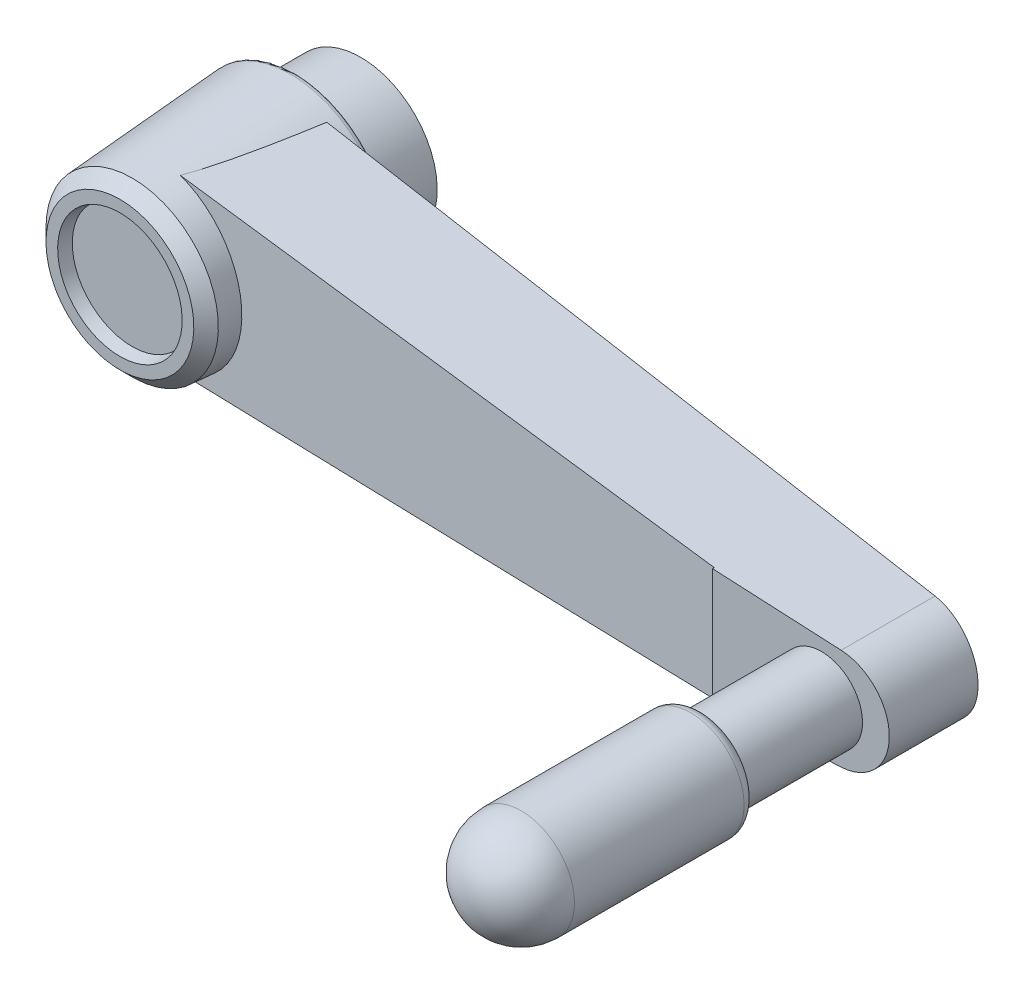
ISO-10303-21;
HEADER;
FILE_DESCRIPTION(('STEP AP214'),'2;1');
FILE_NAME('part.step','',(''),(''),'','','');
FILE_SCHEMA(('AUTOMOTIVE_DESIGN { 1 0 10303 214 1 1 1 1 }'));
ENDSEC;
DATA;
#1=APPLICATION_CONTEXT('core data for automotive mechanical design processes');
#2=APPLICATION_PROTOCOL_DEFINITION('international standard','automotive_design',2000,#1);
#3=PRODUCT_CONTEXT('',#1,'mechanical');
#4=PRODUCT('Part','Part','',(#3));
#5=PRODUCT_RELATED_PRODUCT_CATEGORY('part','',(#4));
#6=PRODUCT_DEFINITION_FORMATION('','',#4);
#7=PRODUCT_DEFINITION_CONTEXT('part definition',#1,'design');
#8=PRODUCT_DEFINITION('design','',#6,#7);
#9=PRODUCT_DEFINITION_SHAPE('','',#8);
#10=(LENGTH_UNIT() NAMED_UNIT(*) SI_UNIT(.MILLI.,.METRE.));
#11=(NAMED_UNIT(*) PLANE_ANGLE_UNIT() SI_UNIT($,.RADIAN.));
#12=(NAMED_UNIT(*) SI_UNIT($,.STERADIAN.) SOLID_ANGLE_UNIT());
#13=UNCERTAINTY_MEASURE_WITH_UNIT(LENGTH_MEASURE(1.E-05),#10,'distance_accuracy_value','');
#14=(GEOMETRIC_REPRESENTATION_CONTEXT(3) GLOBAL_UNCERTAINTY_ASSIGNED_CONTEXT((#13)) GLOBAL_UNIT_ASSIGNED_CONTEXT((#10,
#11,#12)) REPRESENTATION_CONTEXT('',''));
#15=CARTESIAN_POINT('',(0.,0.,0.));
#16=DIRECTION('',(0.,0.,1.));
#17=DIRECTION('',(1.,0.,0.));
#18=AXIS2_PLACEMENT_3D('',#15,#16,#17);
#19=CARTESIAN_POINT('',(0.,0.,30.0000000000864));
#20=DIRECTION('',(0.,0.,-1.));
#21=DIRECTION('',(0.,1.,0.));
#22=AXIS2_PLACEMENT_3D('',#19,#20,#21);
#23=CONICAL_SURFACE('',#22,7.99999999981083,1.04719755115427);
#24=CARTESIAN_POINT('',(1.98951966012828E-10,0.,34.6188021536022));
#25=VERTEX_POINT('',#24);
#26=VERTEX_LOOP('',#25);
#27=FACE_BOUND('',#26,.T.);
#28=CARTESIAN_POINT('',(0.,0.,30.));
#29=DIRECTION('',(0.,0.,-1.));
#30=DIRECTION('',(0.,1.,0.));
#31=AXIS2_PLACEMENT_3D('',#28,#29,#30);
#32=CIRCLE('',#31,8.);
#33=CARTESIAN_POINT('',(0.,8.,30.));
#34=VERTEX_POINT('',#33);
#35=EDGE_CURVE('E296',#34,#34,#32,.T.);
#36=ORIENTED_EDGE('',*,*,#35,.T.);
#37=EDGE_LOOP('',(#36));
#38=FACE_BOUND('',#37,.T.);
#39=ADVANCED_FACE('F15',(#27,#38),#23,.F.);
#40=CARTESIAN_POINT('',(0.,0.,15.55));
#41=DIRECTION('',(0.,0.,-1.));
#42=DIRECTION('',(0.,1.,0.));
#43=AXIS2_PLACEMENT_3D('',#40,#41,#42);
#44=CYLINDRICAL_SURFACE('',#43,8.);
#45=CARTESIAN_POINT('',(0.,0.,1.1));
#46=DIRECTION('',(0.,0.,-1.));
#47=DIRECTION('',(1.,0.,0.));
#48=AXIS2_PLACEMENT_3D('',#45,#46,#47);
#49=CIRCLE('',#48,8.);
#50=CARTESIAN_POINT('',(8.,0.,1.1));
#51=VERTEX_POINT('',#50);
#52=EDGE_CURVE('E287',#51,#51,#49,.T.);
#53=ORIENTED_EDGE('',*,*,#52,.T.);
#54=EDGE_LOOP('',(#53));
#55=FACE_BOUND('',#54,.T.);
#56=ORIENTED_EDGE('',*,*,#35,.F.);
#57=EDGE_LOOP('',(#56));
#58=FACE_BOUND('',#57,.T.);
#59=ADVANCED_FACE('F397',(#55,#58),#44,.F.);
#60=CARTESIAN_POINT('',(0.,0.,0.));
#61=DIRECTION('',(0.,0.,-1.));
#62=DIRECTION('',(0.,1.,0.));
#63=AXIS2_PLACEMENT_3D('',#60,#61,#62);
#64=CONICAL_SURFACE('',#63,9.1,0.785398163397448);
#65=CARTESIAN_POINT('',(0.,0.,0.));
#66=DIRECTION('',(0.,0.,-1.));
#67=DIRECTION('',(0.,1.,0.));
#68=AXIS2_PLACEMENT_3D('',#65,#66,#67);
#69=CIRCLE('',#68,9.1);
#70=CARTESIAN_POINT('',(0.,9.1,0.));
#71=VERTEX_POINT('',#70);
#72=EDGE_CURVE('E284',#71,#71,#69,.F.);
#73=ORIENTED_EDGE('',*,*,#72,.F.);
#74=EDGE_LOOP('',(#73));
#75=FACE_BOUND('',#74,.T.);
#76=ORIENTED_EDGE('',*,*,#52,.F.);
#77=EDGE_LOOP('',(#76));
#78=FACE_BOUND('',#77,.T.);
#79=ADVANCED_FACE('F402',(#75,#78),#64,.F.);
#80=CARTESIAN_POINT('',(-6.5,0.,0.));
#81=DIRECTION('',(0.,0.,-1.));
#82=DIRECTION('',(0.,1.,0.));
#83=AXIS2_PLACEMENT_3D('',#80,#81,#82);
#84=PLANE('',#83);
#85=CARTESIAN_POINT('',(0.,0.,0.));
#86=DIRECTION('',(0.,0.,1.));
#87=DIRECTION('',(0.,-1.,0.));
#88=AXIS2_PLACEMENT_3D('',#85,#86,#87);
#89=CIRCLE('',#88,13.);
#90=CARTESIAN_POINT('',(0.,-13.,0.));
#91=VERTEX_POINT('',#90);
#92=EDGE_CURVE('E281',#91,#91,#89,.T.);
#93=ORIENTED_EDGE('',*,*,#92,.F.);
#94=EDGE_LOOP('',(#93));
#95=FACE_BOUND('',#94,.T.);
#96=ORIENTED_EDGE('',*,*,#72,.T.);
#97=EDGE_LOOP('',(#96));
#98=FACE_BOUND('',#97,.T.);
#99=ADVANCED_FACE('F518',(#95,#98),#84,.T.);
#100=CARTESIAN_POINT('',(0.,0.,0.1));
#101=DIRECTION('',(0.,0.,1.));
#102=DIRECTION('',(0.,-1.,0.));
#103=AXIS2_PLACEMENT_3D('',#100,#101,#102);
#104=CYLINDRICAL_SURFACE('',#103,13.);
#105=ORIENTED_EDGE('',*,*,#92,.T.);
#106=EDGE_LOOP('',(#105));
#107=FACE_BOUND('',#106,.T.);
#108=CARTESIAN_POINT('',(0.,0.,0.200000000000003));
#109=DIRECTION('',(0.,0.,1.));
#110=DIRECTION('',(0.,-1.,0.));
#111=AXIS2_PLACEMENT_3D('',#108,#109,#110);
#112=CIRCLE('',#111,13.);
#113=CARTESIAN_POINT('',(0.,-13.,0.200000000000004));
#114=VERTEX_POINT('',#113);
#115=EDGE_CURVE('E278',#114,#114,#112,.T.);
#116=ORIENTED_EDGE('',*,*,#115,.F.);
#117=EDGE_LOOP('',(#116));
#118=FACE_BOUND('',#117,.T.);
#119=ADVANCED_FACE('F514',(#107,#118),#104,.T.);
#120=CARTESIAN_POINT('',(-15.125,0.,0.2));
#121=DIRECTION('',(0.,0.,-1.));
#122=DIRECTION('',(1.,0.,0.));
#123=AXIS2_PLACEMENT_3D('',#120,#121,#122);
#124=PLANE('',#123);
#125=CARTESIAN_POINT('',(0.,0.,0.2));
#126=DIRECTION('',(0.,0.,1.));
#127=DIRECTION('',(0.,-1.,0.));
#128=AXIS2_PLACEMENT_3D('',#125,#126,#127);
#129=CIRCLE('',#128,17.25);
#130=CARTESIAN_POINT('',(0.,-17.25,0.200000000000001));
#131=VERTEX_POINT('',#130);
#132=EDGE_CURVE('E271',#131,#131,#129,.T.);
#133=ORIENTED_EDGE('',*,*,#132,.F.);
#134=EDGE_LOOP('',(#133));
#135=FACE_BOUND('',#134,.T.);
#136=ORIENTED_EDGE('',*,*,#115,.T.);
#137=EDGE_LOOP('',(#136));
#138=FACE_BOUND('',#137,.T.);
#139=ADVANCED_FACE('F509',(#135,#138),#124,.T.);
#140=CARTESIAN_POINT('',(-6.75,0.,51.735));
#141=DIRECTION('',(0.,0.,1.));
#142=DIRECTION('',(0.,-1.,0.));
#143=AXIS2_PLACEMENT_3D('',#140,#141,#142);
#144=PLANE('',#143);
#145=CARTESIAN_POINT('',(0.,0.,51.735));
#146=DIRECTION('',(0.,0.,1.));
#147=DIRECTION('',(0.,-1.,0.));
#148=AXIS2_PLACEMENT_3D('',#145,#146,#147);
#149=CIRCLE('',#148,13.5);
#150=CARTESIAN_POINT('',(0.,-13.5,51.735));
#151=VERTEX_POINT('',#150);
#152=EDGE_CURVE('E263',#151,#151,#149,.T.);
#153=ORIENTED_EDGE('',*,*,#152,.T.);
#154=EDGE_LOOP('',(#153));
#155=FACE_BOUND('',#154,.T.);
#156=ADVANCED_FACE('F242',(#155),#144,.T.);
#157=CARTESIAN_POINT('',(0.,0.,7.6));
#158=DIRECTION('',(0.,0.,1.));
#159=DIRECTION('',(0.,-1.,0.));
#160=AXIS2_PLACEMENT_3D('',#157,#158,#159);
#161=CYLINDRICAL_SURFACE('',#160,17.25);
#162=ORIENTED_EDGE('',*,*,#132,.T.);
#163=EDGE_LOOP('',(#162));
#164=FACE_BOUND('',#163,.T.);
#165=CARTESIAN_POINT('',(0.,0.,15.));
#166=DIRECTION('',(0.,0.,1.));
#167=DIRECTION('',(0.,-1.,0.));
#168=AXIS2_PLACEMENT_3D('',#165,#166,#167);
#169=CIRCLE('',#168,17.25);
#170=CARTESIAN_POINT('',(0.,-17.25,15.));
#171=VERTEX_POINT('',#170);
#172=EDGE_CURVE('E266',#171,#171,#169,.T.);
#173=ORIENTED_EDGE('',*,*,#172,.F.);
#174=EDGE_LOOP('',(#173));
#175=FACE_BOUND('',#174,.T.);
#176=ADVANCED_FACE('F501',(#164,#175),#161,.T.);
#177=CARTESIAN_POINT('',(0.,0.,54.5));
#178=DIRECTION('',(0.,0.,1.));
#179=DIRECTION('',(0.,-1.,0.));
#180=AXIS2_PLACEMENT_3D('',#177,#178,#179);
#181=CONICAL_SURFACE('',#180,14.0374615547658,0.191986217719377);
#182=CARTESIAN_POINT('',(0.,0.,54.5));
#183=DIRECTION('',(0.,0.,1.));
#184=DIRECTION('',(0.,-1.,0.));
#185=AXIS2_PLACEMENT_3D('',#182,#183,#184);
#186=CIRCLE('',#185,14.0374615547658);
#187=CARTESIAN_POINT('',(0.,-14.0374615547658,54.5));
#188=VERTEX_POINT('',#187);
#189=EDGE_CURVE('E217',#188,#188,#186,.F.);
#190=ORIENTED_EDGE('',*,*,#189,.F.);
#191=EDGE_LOOP('',(#190));
#192=FACE_BOUND('',#191,.T.);
#193=ORIENTED_EDGE('',*,*,#152,.F.);
#194=EDGE_LOOP('',(#193));
#195=FACE_BOUND('',#194,.T.);
#196=ADVANCED_FACE('F240',(#192,#195),#181,.F.);
#197=CARTESIAN_POINT('',(-19.0888156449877,0.,15.));
#198=DIRECTION('',(0.,0.,-1.));
#199=DIRECTION('',(0.,1.,0.));
#200=AXIS2_PLACEMENT_3D('',#197,#198,#199);
#201=PLANE('',#200);
#202=CARTESIAN_POINT('',(0.,0.,15.));
#203=DIRECTION('',(0.,0.,1.));
#204=DIRECTION('',(0.,-1.,0.));
#205=AXIS2_PLACEMENT_3D('',#202,#203,#204);
#206=CIRCLE('',#205,20.9276312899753);
#207=CARTESIAN_POINT('',(0.,-20.9276312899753,15.));
#208=VERTEX_POINT('',#207);
#209=CARTESIAN_POINT('',(0.,20.9276312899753,15.));
#210=VERTEX_POINT('',#209);
#211=EDGE_CURVE('E147',#208,#210,#206,.T.);
#212=ORIENTED_EDGE('',*,*,#211,.F.);
#213=CARTESIAN_POINT('',(0.,0.,15.));
#214=DIRECTION('',(0.,0.,1.));
#215=DIRECTION('',(-1.,0.,0.));
#216=AXIS2_PLACEMENT_3D('',#213,#214,#215);
#217=CIRCLE('',#216,20.9276312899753);
#218=CARTESIAN_POINT('',(-20.9276312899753,0.,15.));
#219=VERTEX_POINT('',#218);
#220=EDGE_CURVE('E259',#219,#208,#217,.T.);
#221=ORIENTED_EDGE('',*,*,#220,.F.);
#222=CARTESIAN_POINT('',(0.,0.,15.));
#223=DIRECTION('',(0.,0.,1.));
#224=DIRECTION('',(0.,1.,0.));
#225=AXIS2_PLACEMENT_3D('',#222,#223,#224);
#226=CIRCLE('',#225,20.9276312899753);
#227=EDGE_CURVE('E223',#210,#219,#226,.T.);
#228=ORIENTED_EDGE('',*,*,#227,.F.);
#229=EDGE_LOOP('',(#212,#221,#228));
#230=FACE_BOUND('',#229,.T.);
#231=ORIENTED_EDGE('',*,*,#172,.T.);
#232=EDGE_LOOP('',(#231));
#233=FACE_BOUND('',#232,.T.);
#234=ADVANCED_FACE('F229',(#230,#233),#201,.T.);
#235=CARTESIAN_POINT('',(-15.3518500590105,0.,54.5));
#236=DIRECTION('',(0.,0.,1.));
#237=DIRECTION('',(0.,-1.,0.));
#238=AXIS2_PLACEMENT_3D('',#235,#236,#237);
#239=PLANE('',#238);
#240=ORIENTED_EDGE('',*,*,#189,.T.);
#241=EDGE_LOOP('',(#240));
#242=FACE_BOUND('',#241,.T.);
#243=CARTESIAN_POINT('',(0.,0.,54.5));
#244=DIRECTION('',(0.,0.,-1.));
#245=DIRECTION('',(0.,1.,0.));
#246=AXIS2_PLACEMENT_3D('',#243,#244,#245);
#247=CIRCLE('',#246,16.6662385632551);
#248=CARTESIAN_POINT('',(0.,16.6662385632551,54.5));
#249=VERTEX_POINT('',#248);
#250=EDGE_CURVE('E197',#249,#249,#247,.T.);
#251=ORIENTED_EDGE('',*,*,#250,.F.);
#252=EDGE_LOOP('',(#251));
#253=FACE_BOUND('',#252,.T.);
#254=ADVANCED_FACE('F239',(#242,#253),#239,.T.);
#255=CARTESIAN_POINT('',(0.,0.,51.735));
#256=DIRECTION('',(0.,0.,-1.));
#257=DIRECTION('',(0.,1.,0.));
#258=AXIS2_PLACEMENT_3D('',#255,#256,#257);
#259=CONICAL_SURFACE('',#258,19.4312385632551,0.785398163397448);
#260=CARTESIAN_POINT('',(0.,0.,51.735));
#261=DIRECTION('',(0.,0.,-1.));
#262=DIRECTION('',(-1.,0.,0.));
#263=AXIS2_PLACEMENT_3D('',#260,#261,#262);
#264=CIRCLE('',#263,19.4312385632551);
#265=CARTESIAN_POINT('',(-19.4312385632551,0.,51.735));
#266=VERTEX_POINT('',#265);
#267=EDGE_CURVE('E177',#266,#266,#264,.T.);
#268=ORIENTED_EDGE('',*,*,#267,.F.);
#269=EDGE_LOOP('',(#268));
#270=FACE_BOUND('',#269,.T.);
#271=ORIENTED_EDGE('',*,*,#250,.T.);
#272=EDGE_LOOP('',(#271));
#273=FACE_BOUND('',#272,.T.);
#274=ADVANCED_FACE('F166',(#270,#273),#259,.T.);
#275=CARTESIAN_POINT('',(0.,0.,16.));
#276=DIRECTION('',(0.,0.,-1.));
#277=DIRECTION('',(0.,1.,0.));
#278=AXIS2_PLACEMENT_3D('',#275,#276,#277);
#279=TOROIDAL_SURFACE('',#278,20.9276312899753,1.);
#280=ORIENTED_EDGE('',*,*,#220,.T.);
#281=ORIENTED_EDGE('',*,*,#211,.T.);
#282=ORIENTED_EDGE('',*,*,#227,.T.);
#283=EDGE_LOOP('',(#280,#281,#282));
#284=FACE_BOUND('',#283,.T.);
#285=CARTESIAN_POINT('',(0.,0.,16.0697564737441));
#286=DIRECTION('',(0.,0.,-1.));
#287=DIRECTION('',(-1.,0.,0.));
#288=AXIS2_PLACEMENT_3D('',#285,#286,#287);
#289=CIRCLE('',#288,21.9251953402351);
#290=CARTESIAN_POINT('',(-21.9251953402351,0.,16.0697564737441));
#291=VERTEX_POINT('',#290);
#292=EDGE_CURVE('E175',#291,#291,#289,.F.);
#293=ORIENTED_EDGE('',*,*,#292,.F.);
#294=EDGE_LOOP('',(#293));
#295=FACE_BOUND('',#294,.T.);
#296=ADVANCED_FACE('F154',(#284,#295),#279,.T.);
#297=CARTESIAN_POINT('',(-21.9,-39.5,43.6));
#298=DIRECTION('',(0.0762108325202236,0.,-0.997091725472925));
#299=DIRECTION('',(0.997091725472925,0.,0.0762108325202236));
#300=AXIS2_PLACEMENT_3D('',#297,#298,#299);
#301=PLANE('',#300);
#302=CARTESIAN_POINT('',(-0.106272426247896,0.,45.2657626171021));
#303=DIRECTION('',(0.0762108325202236,0.,-0.997091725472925));
#304=DIRECTION('',(-0.997091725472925,0.,-0.0762108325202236));
#305=AXIS2_PLACEMENT_3D('',#302,#303,#304);
#306=ELLIPSE('',#305,19.941607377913,19.8833277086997);
#307=CARTESIAN_POINT('',(4.74949230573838,-19.2813107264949,45.6369038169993));
#308=VERTEX_POINT('',#307);
#309=CARTESIAN_POINT('',(4.74949230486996,19.2813107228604,45.6369038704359));
#310=VERTEX_POINT('',#309);
#311=EDGE_CURVE('E181',#308,#310,#306,.F.);
#312=ORIENTED_EDGE('',*,*,#311,.F.);
#313=DIRECTION('',(-0.995886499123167,-0.0491530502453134,-0.0761187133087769));
#314=VECTOR('',#313,1.);
#315=CARTESIAN_POINT('',(135.1,-12.8477210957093,55.6));
#316=LINE('',#315,#314);
#317=CARTESIAN_POINT('',(135.1,-12.8477210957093,55.6));
#318=VERTEX_POINT('',#317);
#319=EDGE_CURVE('E203',#318,#308,#316,.T.);
#320=ORIENTED_EDGE('',*,*,#319,.F.);
#321=DIRECTION('',(0.,-1.,0.));
#322=VECTOR('',#321,1.);
#323=CARTESIAN_POINT('',(135.1,-39.5,55.6));
#324=LINE('',#323,#322);
#325=CARTESIAN_POINT('',(135.1,12.8477210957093,55.6));
#326=VERTEX_POINT('',#325);
#327=EDGE_CURVE('E191',#326,#318,#324,.T.);
#328=ORIENTED_EDGE('',*,*,#327,.F.);
#329=DIRECTION('',(0.995886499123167,-0.0491530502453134,0.076118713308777));
#330=VECTOR('',#329,1.);
#331=CARTESIAN_POINT('',(4.74949228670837,19.2813107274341,45.6369038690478));
#332=LINE('',#331,#330);
#333=EDGE_CURVE('E185',#310,#326,#332,.T.);
#334=ORIENTED_EDGE('',*,*,#333,.F.);
#335=EDGE_LOOP('',(#312,#320,#328,#334));
#336=FACE_BOUND('',#335,.T.);
#337=ADVANCED_FACE('F165',(#336),#301,.F.);
#338=CARTESIAN_POINT('',(0.,0.,16.0697564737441));
#339=DIRECTION('',(0.,0.,-1.));
#340=DIRECTION('',(0.,1.,0.));
#341=AXIS2_PLACEMENT_3D('',#338,#339,#340);
#342=CONICAL_SURFACE('',#341,21.9251953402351,0.0698131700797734);
#343=ORIENTED_EDGE('',*,*,#292,.T.);
#344=EDGE_LOOP('',(#343));
#345=FACE_BOUND('',#344,.T.);
#346=CARTESIAN_POINT('',(-0.162782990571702,0.,17.3171652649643));
#347=DIRECTION('',(-0.105998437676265,0.,0.994366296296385));
#348=DIRECTION('',(-0.994366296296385,0.,-0.105998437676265));
#349=AXIS2_PLACEMENT_3D('',#346,#347,#348);
#350=ELLIPSE('',#349,21.9616936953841,21.8373613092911);
#351=CARTESIAN_POINT('',(10.6163852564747,18.9917439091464,18.4662137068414));
#352=VERTEX_POINT('',#351);
#353=CARTESIAN_POINT('',(10.6163852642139,-18.9917439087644,18.4662136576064));
#354=VERTEX_POINT('',#353);
#355=EDGE_CURVE('E291',#352,#354,#350,.F.);
#356=ORIENTED_EDGE('',*,*,#355,.T.);
#357=CARTESIAN_POINT('',(10.6163852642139,-18.9917439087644,18.4662136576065));
#358=CARTESIAN_POINT('',(10.4361579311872,-19.0006392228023,19.6121865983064));
#359=CARTESIAN_POINT('',(10.2521510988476,-19.0097210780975,20.7575811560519));
#360=CARTESIAN_POINT('',(9.87473300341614,-19.0283489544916,23.0467138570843));
#361=CARTESIAN_POINT('',(9.68132253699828,-19.0378949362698,24.190452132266));
#362=CARTESIAN_POINT('',(9.28353265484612,-19.057528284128,26.4741824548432));
#363=CARTESIAN_POINT('',(9.07917083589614,-19.0676147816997,27.6141775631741));
#364=CARTESIAN_POINT('',(8.6564662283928,-19.0884778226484,29.8917311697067));
#365=CARTESIAN_POINT('',(8.43812174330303,-19.0992544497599,31.0292893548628));
#366=CARTESIAN_POINT('',(8.09707608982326,-19.1160871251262,32.7333362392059));
#367=CARTESIAN_POINT('',(7.98109510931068,-19.121811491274,33.3011745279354));
#368=CARTESIAN_POINT('',(7.74394249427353,-19.1335164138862,34.4357597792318));
#369=CARTESIAN_POINT('',(7.62277092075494,-19.1394969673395,35.0025067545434));
#370=CARTESIAN_POINT('',(7.37441935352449,-19.151754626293,36.1345051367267));
#371=CARTESIAN_POINT('',(7.24724116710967,-19.158031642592,36.6997569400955));
#372=CARTESIAN_POINT('',(6.98572118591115,-19.1709392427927,37.8286300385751));
#373=CARTESIAN_POINT('',(6.85137907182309,-19.1775698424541,38.3922512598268));
#374=CARTESIAN_POINT('',(6.57381367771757,-19.1912693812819,39.5183010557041));
#375=CARTESIAN_POINT('',(6.43057596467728,-19.1983390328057,40.0807260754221));
#376=CARTESIAN_POINT('',(6.13337897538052,-19.2130075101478,41.2026819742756));
#377=CARTESIAN_POINT('',(5.97942102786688,-19.2206062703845,41.7622132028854));
#378=CARTESIAN_POINT('',(5.73806291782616,-19.2325187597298,42.5988017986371));
#379=CARTESIAN_POINT('',(5.6558287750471,-19.2365775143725,42.877354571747));
#380=CARTESIAN_POINT('',(5.48736442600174,-19.244892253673,43.4332386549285));
#381=CARTESIAN_POINT('',(5.40113435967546,-19.249148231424,43.7105700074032));
#382=CARTESIAN_POINT('',(5.22399878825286,-19.2578909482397,44.263864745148));
#383=CARTESIAN_POINT('',(5.13309138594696,-19.2623777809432,44.5398275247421));
#384=CARTESIAN_POINT('',(4.94570156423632,-19.2716266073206,45.0898825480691));
#385=CARTESIAN_POINT('',(4.84921847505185,-19.2763886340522,45.3639745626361));
#386=CARTESIAN_POINT('',(4.74949232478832,-19.2813107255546,45.6369037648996));
#387=B_SPLINE_CURVE_WITH_KNOTS('',3,(#357,#358,#359,#360,#361,#362,#363,#364,#365,#366,#367,
#368,#369,#370,#371,#372,#373,#374,#375,#376,#377,#378,#379,#380,#381,#382,#383,#384,#385,#386),
.UNSPECIFIED.,.F.,.F.,(4,2,2,2,2,2,2,2,2,2,2,2,2,2,4),(0.,3.48029795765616,6.96030157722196,
10.4348720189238,13.9098648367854,15.6486159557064,17.3873466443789,19.1255574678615,
20.8638458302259,22.6050322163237,24.3460031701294,25.2173773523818,26.0887210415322,
26.9604209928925,27.8322258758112),.UNSPECIFIED.);
#388=EDGE_CURVE('E421',#354,#308,#387,.T.);
#389=ORIENTED_EDGE('',*,*,#388,.T.);
#390=ORIENTED_EDGE('',*,*,#311,.T.);
#391=CARTESIAN_POINT('',(4.74949229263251,19.2813107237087,45.6369038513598));
#392=CARTESIAN_POINT('',(4.84921844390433,19.2763886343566,45.3639746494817));
#393=CARTESIAN_POINT('',(4.94570153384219,19.2716266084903,45.0898826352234));
#394=CARTESIAN_POINT('',(5.13309135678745,19.2623777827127,44.5398276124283));
#395=CARTESIAN_POINT('',(5.22399875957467,19.2578909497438,44.2638648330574));
#396=CARTESIAN_POINT('',(5.4011343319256,19.249148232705,43.7105700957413));
#397=CARTESIAN_POINT('',(5.48736439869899,19.2448922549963,43.4332387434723));
#398=CARTESIAN_POINT('',(5.65582874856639,19.2365775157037,42.8773546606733));
#399=CARTESIAN_POINT('',(5.73806289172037,19.2325187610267,42.5988018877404));
#400=CARTESIAN_POINT('',(5.97942100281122,19.2206062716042,41.7622132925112));
#401=CARTESIAN_POINT('',(6.13337895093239,19.2130075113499,41.2026820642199));
#402=CARTESIAN_POINT('',(6.43057594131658,19.1983390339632,40.0807261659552));
#403=CARTESIAN_POINT('',(6.5738136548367,19.1912693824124,39.5183011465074));
#404=CARTESIAN_POINT('',(6.85137904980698,19.1775698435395,38.3922513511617));
#405=CARTESIAN_POINT('',(6.98572116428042,19.17093924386,37.8286301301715));
#406=CARTESIAN_POINT('',(7.24724114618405,19.1580316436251,36.6997570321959));
#407=CARTESIAN_POINT('',(7.37441933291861,19.15175462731,36.1345052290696));
#408=CARTESIAN_POINT('',(7.62277090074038,19.1394969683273,35.0025068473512));
#409=CARTESIAN_POINT('',(7.74394247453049,19.1335164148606,34.4357598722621));
#410=CARTESIAN_POINT('',(7.98109509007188,19.1218114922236,33.3011746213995));
#411=CARTESIAN_POINT('',(8.0970760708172,19.1160871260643,32.7333363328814));
#412=CARTESIAN_POINT('',(8.43812172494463,19.099254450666,31.0292894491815));
#413=CARTESIAN_POINT('',(8.65646621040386,19.0884778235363,29.8917312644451));
#414=CARTESIAN_POINT('',(9.07917081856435,19.0676147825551,27.6141776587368));
#415=CARTESIAN_POINT('',(9.28353263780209,19.0575282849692,26.4741825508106));
#416=CARTESIAN_POINT('',(9.68132252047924,19.0378949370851,24.1904522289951));
#417=CARTESIAN_POINT('',(9.8747329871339,19.0283489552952,23.0467139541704));
#418=CARTESIAN_POINT('',(10.2521510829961,19.0097210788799,20.7575812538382));
#419=CARTESIAN_POINT('',(10.4361579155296,19.0006392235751,19.6121866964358));
#420=CARTESIAN_POINT('',(10.6163852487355,18.9917439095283,18.4662137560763));
#421=B_SPLINE_CURVE_WITH_KNOTS('',3,(#391,#392,#393,#394,#395,#396,#397,#398,#399,#400,#401,
#402,#403,#404,#405,#406,#407,#408,#409,#410,#411,#412,#413,#414,#415,#416,#417,#418,#419,#420),
.UNSPECIFIED.,.F.,.F.,(4,2,2,2,2,2,2,2,2,2,2,2,2,2,4),(0.,0.871804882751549,1.74350483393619,
2.61484852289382,3.48622270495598,5.22719365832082,6.96838004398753,8.70666840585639,
10.4448792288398,12.1836099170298,13.9223610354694,17.3973538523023,20.8719242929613,
24.3519279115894,27.8322258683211),.UNSPECIFIED.);
#422=EDGE_CURVE('E37',#310,#352,#421,.T.);
#423=ORIENTED_EDGE('',*,*,#422,.T.);
#424=EDGE_LOOP('',(#356,#389,#390,#423));
#425=FACE_BOUND('',#424,.T.);
#426=ORIENTED_EDGE('',*,*,#267,.T.);
#427=EDGE_LOOP('',(#426));
#428=FACE_BOUND('',#427,.T.);
#429=ADVANCED_FACE('F440',(#345,#425,#428),#342,.T.);
#430=CARTESIAN_POINT('',(0.960878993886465,-19.4683018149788,94.));
#431=DIRECTION('',(0.0492960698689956,-0.998784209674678,0.));
#432=DIRECTION('',(0.998784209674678,0.0492960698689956,0.));
#433=AXIS2_PLACEMENT_3D('',#430,#431,#432);
#434=PLANE('',#433);
#435=DIRECTION('',(-1.42108547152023E-13,0.,1.));
#436=VECTOR('',#435,1.);
#437=CARTESIAN_POINT('',(135.1,-12.8477210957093,55.6));
#438=LINE('',#437,#436);
#439=CARTESIAN_POINT('',(135.1,-12.8477210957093,56.));
#440=VERTEX_POINT('',#439);
#441=EDGE_CURVE('E212',#440,#318,#438,.F.);
#442=ORIENTED_EDGE('',*,*,#441,.T.);
#443=ORIENTED_EDGE('',*,*,#319,.T.);
#444=ORIENTED_EDGE('',*,*,#388,.F.);
#445=DIRECTION('',(0.993170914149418,0.0490190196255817,0.105871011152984));
#446=VECTOR('',#445,1.);
#447=CARTESIAN_POINT('',(10.6163852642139,-18.9917439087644,18.4662136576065));
#448=LINE('',#447,#446);
#449=CARTESIAN_POINT('',(164.134812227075,-11.4146766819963,34.8311221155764));
#450=VERTEX_POINT('',#449);
#451=EDGE_CURVE('E417',#354,#450,#448,.T.);
#452=ORIENTED_EDGE('',*,*,#451,.T.);
#453=DIRECTION('',(0.,0.,1.));
#454=VECTOR('',#453,1.);
#455=CARTESIAN_POINT('',(164.134812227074,-11.4146766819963,94.));
#456=LINE('',#455,#454);
#457=CARTESIAN_POINT('',(164.134812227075,-11.4146766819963,56.));
#458=VERTEX_POINT('',#457);
#459=EDGE_CURVE('E463',#458,#450,#456,.F.);
#460=ORIENTED_EDGE('',*,*,#459,.F.);
#461=DIRECTION('',(0.998784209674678,0.0492960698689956,0.));
#462=VECTOR('',#461,1.);
#463=CARTESIAN_POINT('',(0.960878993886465,-19.4683018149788,56.));
#464=LINE('',#463,#462);
#465=EDGE_CURVE('E200',#458,#440,#464,.F.);
#466=ORIENTED_EDGE('',*,*,#465,.T.);
#467=EDGE_LOOP('',(#442,#443,#444,#452,#460,#466));
#468=FACE_BOUND('',#467,.T.);
#469=ADVANCED_FACE('F436',(#468),#434,.T.);
#470=CARTESIAN_POINT('',(135.1,-39.5,55.6));
#471=DIRECTION('',(1.,0.,1.42108547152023E-13));
#472=DIRECTION('',(-1.42108547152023E-13,0.,1.));
#473=AXIS2_PLACEMENT_3D('',#470,#471,#472);
#474=PLANE('',#473);
#475=DIRECTION('',(0.,-1.,0.));
#476=VECTOR('',#475,1.);
#477=CARTESIAN_POINT('',(135.1,-39.5,56.));
#478=LINE('',#477,#476);
#479=CARTESIAN_POINT('',(135.1,12.8477210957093,56.));
#480=VERTEX_POINT('',#479);
#481=EDGE_CURVE('E188',#440,#480,#478,.F.);
#482=ORIENTED_EDGE('',*,*,#481,.T.);
#483=DIRECTION('',(-1.42108547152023E-13,0.,1.));
#484=VECTOR('',#483,1.);
#485=CARTESIAN_POINT('',(135.1,12.8477210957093,55.6));
#486=LINE('',#485,#484);
#487=EDGE_CURVE('E209',#326,#480,#486,.T.);
#488=ORIENTED_EDGE('',*,*,#487,.F.);
#489=ORIENTED_EDGE('',*,*,#327,.T.);
#490=ORIENTED_EDGE('',*,*,#441,.F.);
#491=EDGE_LOOP('',(#482,#488,#489,#490));
#492=FACE_BOUND('',#491,.T.);
#493=ADVANCED_FACE('F451',(#492),#474,.F.);
#494=CARTESIAN_POINT('',(164.134812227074,11.4146766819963,94.));
#495=DIRECTION('',(0.0492960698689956,0.998784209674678,0.));
#496=DIRECTION('',(-0.998784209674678,0.0492960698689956,0.));
#497=AXIS2_PLACEMENT_3D('',#494,#495,#496);
#498=PLANE('',#497);
#499=DIRECTION('',(0.,0.,1.));
#500=VECTOR('',#499,1.);
#501=CARTESIAN_POINT('',(164.134812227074,11.4146766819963,94.));
#502=LINE('',#501,#500);
#503=CARTESIAN_POINT('',(164.134812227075,11.4146766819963,56.));
#504=VERTEX_POINT('',#503);
#505=CARTESIAN_POINT('',(164.134812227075,11.4146766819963,34.8311221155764));
#506=VERTEX_POINT('',#505);
#507=EDGE_CURVE('E184',#504,#506,#502,.F.);
#508=ORIENTED_EDGE('',*,*,#507,.T.);
#509=DIRECTION('',(-0.993170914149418,0.0490190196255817,-0.105871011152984));
#510=VECTOR('',#509,1.);
#511=CARTESIAN_POINT('',(164.134812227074,11.4146766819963,34.8311221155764));
#512=LINE('',#511,#510);
#513=EDGE_CURVE('E413',#506,#352,#512,.T.);
#514=ORIENTED_EDGE('',*,*,#513,.T.);
#515=ORIENTED_EDGE('',*,*,#422,.F.);
#516=ORIENTED_EDGE('',*,*,#333,.T.);
#517=ORIENTED_EDGE('',*,*,#487,.T.);
#518=DIRECTION('',(-0.998784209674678,0.0492960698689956,0.));
#519=VECTOR('',#518,1.);
#520=CARTESIAN_POINT('',(164.134812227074,11.4146766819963,56.));
#521=LINE('',#520,#519);
#522=EDGE_CURVE('E182',#480,#504,#521,.F.);
#523=ORIENTED_EDGE('',*,*,#522,.T.);
#524=EDGE_LOOP('',(#508,#514,#515,#516,#517,#523));
#525=FACE_BOUND('',#524,.T.);
#526=ADVANCED_FACE('F446',(#525),#498,.T.);
#527=CARTESIAN_POINT('',(163.571428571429,0.,94.));
#528=DIRECTION('',(0.,0.,1.));
#529=DIRECTION('',(0.,-1.,0.));
#530=AXIS2_PLACEMENT_3D('',#527,#528,#529);
#531=CYLINDRICAL_SURFACE('',#530,11.4285714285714);
#532=CARTESIAN_POINT('',(163.571428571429,0.,34.7710659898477));
#533=DIRECTION('',(-0.105998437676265,0.,0.994366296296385));
#534=DIRECTION('',(0.994366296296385,0.,0.105998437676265));
#535=AXIS2_PLACEMENT_3D('',#532,#533,#534);
#536=ELLIPSE('',#535,11.4933213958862,11.4285714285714);
#537=EDGE_CURVE('E414',#450,#506,#536,.T.);
#538=ORIENTED_EDGE('',*,*,#537,.T.);
#539=ORIENTED_EDGE('',*,*,#507,.F.);
#540=CARTESIAN_POINT('',(163.571428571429,0.,56.));
#541=DIRECTION('',(0.,0.,1.));
#542=DIRECTION('',(0.,-1.,0.));
#543=AXIS2_PLACEMENT_3D('',#540,#541,#542);
#544=CIRCLE('',#543,11.4285714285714);
#545=EDGE_CURVE('E484',#504,#458,#544,.F.);
#546=ORIENTED_EDGE('',*,*,#545,.T.);
#547=ORIENTED_EDGE('',*,*,#459,.T.);
#548=EDGE_LOOP('',(#538,#539,#546,#547));
#549=FACE_BOUND('',#548,.T.);
#550=ADVANCED_FACE('F450',(#549),#531,.T.);
#551=CARTESIAN_POINT('',(135.1,-39.5,56.));
#552=DIRECTION('',(0.,0.,-1.));
#553=DIRECTION('',(1.,0.,0.));
#554=AXIS2_PLACEMENT_3D('',#551,#552,#553);
#555=PLANE('',#554);
#556=CARTESIAN_POINT('',(160.,0.,56.));
#557=DIRECTION('',(0.,0.,-1.));
#558=DIRECTION('',(-1.,0.,0.));
#559=AXIS2_PLACEMENT_3D('',#556,#557,#558);
#560=CIRCLE('',#559,6.9375);
#561=CARTESIAN_POINT('',(153.0625,0.,56.));
#562=VERTEX_POINT('',#561);
#563=EDGE_CURVE('E9',#562,#562,#560,.T.);
#564=ORIENTED_EDGE('',*,*,#563,.T.);
#565=EDGE_LOOP('',(#564));
#566=FACE_BOUND('',#565,.T.);
#567=ORIENTED_EDGE('',*,*,#545,.F.);
#568=ORIENTED_EDGE('',*,*,#522,.F.);
#569=ORIENTED_EDGE('',*,*,#481,.F.);
#570=ORIENTED_EDGE('',*,*,#465,.F.);
#571=EDGE_LOOP('',(#567,#568,#569,#570));
#572=FACE_BOUND('',#571,.T.);
#573=ADVANCED_FACE('F168',(#566,#572),#555,.F.);
#574=CARTESIAN_POINT('',(175.1,-39.5,36.));
#575=DIRECTION('',(-0.105998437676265,0.,0.994366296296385));
#576=DIRECTION('',(-0.994366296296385,0.,-0.105998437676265));
#577=AXIS2_PLACEMENT_3D('',#574,#575,#576);
#578=PLANE('',#577);
#579=ORIENTED_EDGE('',*,*,#355,.F.);
#580=ORIENTED_EDGE('',*,*,#513,.F.);
#581=ORIENTED_EDGE('',*,*,#537,.F.);
#582=ORIENTED_EDGE('',*,*,#451,.F.);
#583=EDGE_LOOP('',(#579,#580,#581,#582));
#584=FACE_BOUND('',#583,.T.);
#585=CARTESIAN_POINT('',(160.,0.,34.3903553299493));
#586=DIRECTION('',(-0.105998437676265,0.,0.994366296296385));
#587=DIRECTION('',(-0.994366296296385,0.,-0.105998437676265));
#588=AXIS2_PLACEMENT_3D('',#585,#586,#587);
#589=ELLIPSE('',#588,3.34232969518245,3.3235);
#590=CARTESIAN_POINT('',(156.6765,0.,34.0360736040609));
#591=VERTEX_POINT('',#590);
#592=EDGE_CURVE('E180',#591,#591,#589,.F.);
#593=ORIENTED_EDGE('',*,*,#592,.F.);
#594=EDGE_LOOP('',(#593));
#595=FACE_BOUND('',#594,.T.);
#596=ADVANCED_FACE('F445',(#584,#595),#578,.F.);
#597=CARTESIAN_POINT('',(160.,0.,44.66175));
#598=DIRECTION('',(0.,0.,-1.));
#599=DIRECTION('',(0.,1.,0.));
#600=AXIS2_PLACEMENT_3D('',#597,#598,#599);
#601=CYLINDRICAL_SURFACE('',#600,3.3235);
#602=ORIENTED_EDGE('',*,*,#592,.T.);
#603=EDGE_LOOP('',(#602));
#604=FACE_BOUND('',#603,.T.);
#605=CARTESIAN_POINT('',(160.,0.,41.0904999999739));
#606=DIRECTION('',(0.,0.,1.));
#607=DIRECTION('',(0.,-1.,0.));
#608=AXIS2_PLACEMENT_3D('',#605,#606,#607);
#609=CIRCLE('',#608,3.3235);
#610=CARTESIAN_POINT('',(160.,-3.3235,41.0904999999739));
#611=VERTEX_POINT('',#610);
#612=EDGE_CURVE('E28',#611,#611,#609,.T.);
#613=ORIENTED_EDGE('',*,*,#612,.T.);
#614=EDGE_LOOP('',(#613));
#615=FACE_BOUND('',#614,.T.);
#616=ADVANCED_FACE('F393',(#604,#615),#601,.F.);
#617=CARTESIAN_POINT('',(160.,0.,45.));
#618=DIRECTION('',(0.,0.,1.));
#619=DIRECTION('',(0.,-1.,0.));
#620=AXIS2_PLACEMENT_3D('',#617,#618,#619);
#621=PLANE('',#620);
#622=DIRECTION('',(-0.866025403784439,0.5,0.));
#623=VECTOR('',#622,1.);
#624=CARTESIAN_POINT('',(160.,2.30940107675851,45.));
#625=LINE('',#624,#623);
#626=CARTESIAN_POINT('',(160.,2.30940107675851,45.));
#627=VERTEX_POINT('',#626);
#628=CARTESIAN_POINT('',(162.,1.15470053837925,45.));
#629=VERTEX_POINT('',#628);
#630=EDGE_CURVE('E354',#627,#629,#625,.F.);
#631=ORIENTED_EDGE('',*,*,#630,.T.);
#632=DIRECTION('',(0.,1.,0.));
#633=VECTOR('',#632,1.);
#634=CARTESIAN_POINT('',(162.,1.15470053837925,45.));
#635=LINE('',#634,#633);
#636=CARTESIAN_POINT('',(162.,-1.15470053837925,45.));
#637=VERTEX_POINT('',#636);
#638=EDGE_CURVE('E359',#629,#637,#635,.F.);
#639=ORIENTED_EDGE('',*,*,#638,.T.);
#640=DIRECTION('',(0.866025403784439,0.5,0.));
#641=VECTOR('',#640,1.);
#642=CARTESIAN_POINT('',(162.,-1.15470053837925,45.));
#643=LINE('',#642,#641);
#644=CARTESIAN_POINT('',(160.,-2.3094010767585,45.));
#645=VERTEX_POINT('',#644);
#646=EDGE_CURVE('E364',#637,#645,#643,.F.);
#647=ORIENTED_EDGE('',*,*,#646,.T.);
#648=DIRECTION('',(0.866025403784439,-0.5,0.));
#649=VECTOR('',#648,1.);
#650=CARTESIAN_POINT('',(160.,-2.30940107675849,45.));
#651=LINE('',#650,#649);
#652=CARTESIAN_POINT('',(158.,-1.15470053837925,45.));
#653=VERTEX_POINT('',#652);
#654=EDGE_CURVE('E114',#645,#653,#651,.F.);
#655=ORIENTED_EDGE('',*,*,#654,.T.);
#656=DIRECTION('',(0.,-1.,0.));
#657=VECTOR('',#656,1.);
#658=CARTESIAN_POINT('',(158.,-1.15470053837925,45.));
#659=LINE('',#658,#657);
#660=CARTESIAN_POINT('',(158.,1.15470053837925,45.));
#661=VERTEX_POINT('',#660);
#662=EDGE_CURVE('E98',#653,#661,#659,.F.);
#663=ORIENTED_EDGE('',*,*,#662,.T.);
#664=DIRECTION('',(-0.866025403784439,-0.5,0.));
#665=VECTOR('',#664,1.);
#666=CARTESIAN_POINT('',(158.,1.15470053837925,45.));
#667=LINE('',#666,#665);
#668=EDGE_CURVE('E103',#661,#627,#667,.F.);
#669=ORIENTED_EDGE('',*,*,#668,.T.);
#670=EDGE_LOOP('',(#631,#639,#647,#655,#663,#669));
#671=FACE_BOUND('',#670,.T.);
#672=ADVANCED_FACE('F17',(#671),#621,.F.);
#673=CARTESIAN_POINT('',(162.,-1.15470053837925,41.));
#674=DIRECTION('',(0.5,-0.866025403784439,0.));
#675=DIRECTION('',(0.866025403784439,0.5,0.));
#676=AXIS2_PLACEMENT_3D('',#673,#674,#675);
#677=PLANE('',#676);
#678=DIRECTION('',(0.,0.,1.));
#679=VECTOR('',#678,1.);
#680=CARTESIAN_POINT('',(162.,-1.15470053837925,41.));
#681=LINE('',#680,#679);
#682=CARTESIAN_POINT('',(162.,-1.15470053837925,41.));
#683=VERTEX_POINT('',#682);
#684=EDGE_CURVE('E362',#637,#683,#681,.F.);
#685=ORIENTED_EDGE('',*,*,#684,.T.);
#686=DIRECTION('',(0.866025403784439,0.5,0.));
#687=VECTOR('',#686,1.);
#688=CARTESIAN_POINT('',(160.,-2.30940107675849,41.));
#689=LINE('',#688,#687);
#690=CARTESIAN_POINT('',(160.,-2.3094010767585,41.));
#691=VERTEX_POINT('',#690);
#692=EDGE_CURVE('E345',#691,#683,#689,.T.);
#693=ORIENTED_EDGE('',*,*,#692,.F.);
#694=DIRECTION('',(0.,0.,1.));
#695=VECTOR('',#694,1.);
#696=CARTESIAN_POINT('',(160.,-2.3094010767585,41.));
#697=LINE('',#696,#695);
#698=EDGE_CURVE('E366',#645,#691,#697,.F.);
#699=ORIENTED_EDGE('',*,*,#698,.F.);
#700=ORIENTED_EDGE('',*,*,#646,.F.);
#701=EDGE_LOOP('',(#685,#693,#699,#700));
#702=FACE_BOUND('',#701,.T.);
#703=ADVANCED_FACE('F384',(#702),#677,.F.);
#704=CARTESIAN_POINT('',(160.,-2.30940107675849,41.));
#705=DIRECTION('',(-0.5,-0.866025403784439,0.));
#706=DIRECTION('',(0.866025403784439,-0.5,0.));
#707=AXIS2_PLACEMENT_3D('',#704,#705,#706);
#708=PLANE('',#707);
#709=ORIENTED_EDGE('',*,*,#698,.T.);
#710=DIRECTION('',(0.866025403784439,-0.5,0.));
#711=VECTOR('',#710,1.);
#712=CARTESIAN_POINT('',(158.,-1.15470053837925,41.));
#713=LINE('',#712,#711);
#714=CARTESIAN_POINT('',(158.,-1.15470053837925,41.));
#715=VERTEX_POINT('',#714);
#716=EDGE_CURVE('E348',#715,#691,#713,.T.);
#717=ORIENTED_EDGE('',*,*,#716,.F.);
#718=DIRECTION('',(0.,0.,1.));
#719=VECTOR('',#718,1.);
#720=CARTESIAN_POINT('',(158.,-1.15470053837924,41.));
#721=LINE('',#720,#719);
#722=EDGE_CURVE('E116',#653,#715,#721,.F.);
#723=ORIENTED_EDGE('',*,*,#722,.F.);
#724=ORIENTED_EDGE('',*,*,#654,.F.);
#725=EDGE_LOOP('',(#709,#717,#723,#724));
#726=FACE_BOUND('',#725,.T.);
#727=ADVANCED_FACE('F370',(#726),#708,.F.);
#728=CARTESIAN_POINT('',(158.,-1.15470053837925,41.));
#729=DIRECTION('',(-1.,0.,0.));
#730=DIRECTION('',(0.,-1.,0.));
#731=AXIS2_PLACEMENT_3D('',#728,#729,#730);
#732=PLANE('',#731);
#733=ORIENTED_EDGE('',*,*,#722,.T.);
#734=DIRECTION('',(0.,1.,0.));
#735=VECTOR('',#734,1.);
#736=CARTESIAN_POINT('',(158.,1.6165,41.));
#737=LINE('',#736,#735);
#738=CARTESIAN_POINT('',(158.,1.15470053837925,41.));
#739=VERTEX_POINT('',#738);
#740=EDGE_CURVE('E120',#739,#715,#737,.F.);
#741=ORIENTED_EDGE('',*,*,#740,.F.);
#742=DIRECTION('',(0.,0.,1.));
#743=VECTOR('',#742,1.);
#744=CARTESIAN_POINT('',(158.,1.15470053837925,41.));
#745=LINE('',#744,#743);
#746=EDGE_CURVE('E105',#661,#739,#745,.F.);
#747=ORIENTED_EDGE('',*,*,#746,.F.);
#748=ORIENTED_EDGE('',*,*,#662,.F.);
#749=EDGE_LOOP('',(#733,#741,#747,#748));
#750=FACE_BOUND('',#749,.T.);
#751=ADVANCED_FACE('F118',(#750),#732,.F.);
#752=CARTESIAN_POINT('',(158.,1.15470053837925,41.));
#753=DIRECTION('',(-0.5,0.866025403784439,0.));
#754=DIRECTION('',(-0.866025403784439,-0.5,0.));
#755=AXIS2_PLACEMENT_3D('',#752,#753,#754);
#756=PLANE('',#755);
#757=ORIENTED_EDGE('',*,*,#746,.T.);
#758=DIRECTION('',(-0.866025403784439,-0.5,0.));
#759=VECTOR('',#758,1.);
#760=CARTESIAN_POINT('',(160.,2.30940107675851,41.));
#761=LINE('',#760,#759);
#762=CARTESIAN_POINT('',(160.,2.30940107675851,41.));
#763=VERTEX_POINT('',#762);
#764=EDGE_CURVE('E352',#763,#739,#761,.T.);
#765=ORIENTED_EDGE('',*,*,#764,.F.);
#766=DIRECTION('',(0.,0.,1.));
#767=VECTOR('',#766,1.);
#768=CARTESIAN_POINT('',(160.,2.30940107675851,41.));
#769=LINE('',#768,#767);
#770=EDGE_CURVE('E108',#763,#627,#769,.T.);
#771=ORIENTED_EDGE('',*,*,#770,.T.);
#772=ORIENTED_EDGE('',*,*,#668,.F.);
#773=EDGE_LOOP('',(#757,#765,#771,#772));
#774=FACE_BOUND('',#773,.T.);
#775=ADVANCED_FACE('F104',(#774),#756,.F.);
#776=CARTESIAN_POINT('',(160.,2.30940107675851,41.));
#777=DIRECTION('',(0.5,0.866025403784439,0.));
#778=DIRECTION('',(-0.866025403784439,0.5,0.));
#779=AXIS2_PLACEMENT_3D('',#776,#777,#778);
#780=PLANE('',#779);
#781=ORIENTED_EDGE('',*,*,#770,.F.);
#782=DIRECTION('',(-0.866025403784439,0.5,0.));
#783=VECTOR('',#782,1.);
#784=CARTESIAN_POINT('',(162.,1.15470053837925,41.));
#785=LINE('',#784,#783);
#786=CARTESIAN_POINT('',(162.,1.15470053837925,41.));
#787=VERTEX_POINT('',#786);
#788=EDGE_CURVE('E139',#787,#763,#785,.T.);
#789=ORIENTED_EDGE('',*,*,#788,.F.);
#790=DIRECTION('',(0.,0.,1.));
#791=VECTOR('',#790,1.);
#792=CARTESIAN_POINT('',(162.,1.15470053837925,41.));
#793=LINE('',#792,#791);
#794=EDGE_CURVE('E357',#629,#787,#793,.F.);
#795=ORIENTED_EDGE('',*,*,#794,.F.);
#796=ORIENTED_EDGE('',*,*,#630,.F.);
#797=EDGE_LOOP('',(#781,#789,#795,#796));
#798=FACE_BOUND('',#797,.T.);
#799=ADVANCED_FACE('F377',(#798),#780,.F.);
#800=CARTESIAN_POINT('',(162.,1.15470053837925,41.));
#801=DIRECTION('',(1.,0.,0.));
#802=DIRECTION('',(0.,1.,0.));
#803=AXIS2_PLACEMENT_3D('',#800,#801,#802);
#804=PLANE('',#803);
#805=ORIENTED_EDGE('',*,*,#794,.T.);
#806=DIRECTION('',(0.,1.,0.));
#807=VECTOR('',#806,1.);
#808=CARTESIAN_POINT('',(162.,1.6165,41.));
#809=LINE('',#808,#807);
#810=EDGE_CURVE('E342',#683,#787,#809,.T.);
#811=ORIENTED_EDGE('',*,*,#810,.F.);
#812=ORIENTED_EDGE('',*,*,#684,.F.);
#813=ORIENTED_EDGE('',*,*,#638,.F.);
#814=EDGE_LOOP('',(#805,#811,#812,#813));
#815=FACE_BOUND('',#814,.T.);
#816=ADVANCED_FACE('F382',(#815),#804,.F.);
#817=CARTESIAN_POINT('',(160.,1.6165,41.));
#818=DIRECTION('',(0.,0.,-1.));
#819=DIRECTION('',(0.,1.,0.));
#820=AXIS2_PLACEMENT_3D('',#817,#818,#819);
#821=PLANE('',#820);
#822=CARTESIAN_POINT('',(160.,0.,40.9999999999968));
#823=DIRECTION('',(0.,0.,1.));
#824=DIRECTION('',(0.,-1.,0.));
#825=AXIS2_PLACEMENT_3D('',#822,#823,#824);
#826=CIRCLE('',#825,3.23300000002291);
#827=CARTESIAN_POINT('',(160.,-3.23300000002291,40.9999999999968));
#828=VERTEX_POINT('',#827);
#829=EDGE_CURVE('E136',#828,#828,#826,.T.);
#830=ORIENTED_EDGE('',*,*,#829,.F.);
#831=EDGE_LOOP('',(#830));
#832=FACE_BOUND('',#831,.T.);
#833=ORIENTED_EDGE('',*,*,#810,.T.);
#834=ORIENTED_EDGE('',*,*,#788,.T.);
#835=ORIENTED_EDGE('',*,*,#764,.T.);
#836=ORIENTED_EDGE('',*,*,#740,.T.);
#837=ORIENTED_EDGE('',*,*,#716,.T.);
#838=ORIENTED_EDGE('',*,*,#692,.T.);
#839=EDGE_LOOP('',(#833,#834,#835,#836,#837,#838));
#840=FACE_BOUND('',#839,.T.);
#841=ADVANCED_FACE('F374',(#832,#840),#821,.T.);
#842=CARTESIAN_POINT('',(160.,0.,41.7669999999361));
#843=DIRECTION('',(0.,0.,1.));
#844=DIRECTION('',(0.,-1.,0.));
#845=AXIS2_PLACEMENT_3D('',#842,#843,#844);
#846=CONICAL_SURFACE('',#845,3.99999999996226,0.785398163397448);
#847=ORIENTED_EDGE('',*,*,#829,.T.);
#848=EDGE_LOOP('',(#847));
#849=FACE_BOUND('',#848,.T.);
#850=ORIENTED_EDGE('',*,*,#612,.F.);
#851=EDGE_LOOP('',(#850));
#852=FACE_BOUND('',#851,.T.);
#853=ADVANCED_FACE('F321',(#849,#852),#846,.T.);
#854=CARTESIAN_POINT('',(160.,0.,124.));
#855=DIRECTION('',(0.,0.,1.));
#856=DIRECTION('',(0.,1.,0.));
#857=AXIS2_PLACEMENT_3D('',#854,#855,#856);
#858=SPHERICAL_SURFACE('',#857,12.);
#859=CARTESIAN_POINT('',(160.,0.,124.));
#860=DIRECTION('',(0.,0.,1.));
#861=DIRECTION('',(0.,-1.,0.));
#862=AXIS2_PLACEMENT_3D('',#859,#860,#861);
#863=CIRCLE('',#862,12.);
#864=CARTESIAN_POINT('',(172.,-1.70219062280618E-11,124.));
#865=VERTEX_POINT('',#864);
#866=EDGE_CURVE('E294',#865,#865,#863,.F.);
#867=ORIENTED_EDGE('',*,*,#866,.F.);
#868=CARTESIAN_POINT('',(160.,0.,136.));
#869=CARTESIAN_POINT('',(160.196349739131,-5.49245087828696E-13,136.000004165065));
#870=CARTESIAN_POINT('',(160.392699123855,-1.10681678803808E-12,135.995181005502));
#871=CARTESIAN_POINT('',(160.784925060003,-2.22061807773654E-12,135.975909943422));
#872=CARTESIAN_POINT('',(160.980801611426,-2.77684766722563E-12,135.961462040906));
#873=CARTESIAN_POINT('',(161.371609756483,-3.8866240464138E-12,135.922971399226));
#874=CARTESIAN_POINT('',(161.566541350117,-4.44017083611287E-12,135.898928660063));
#875=CARTESIAN_POINT('',(161.954990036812,-5.54324825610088E-12,135.841307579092));
#876=CARTESIAN_POINT('',(162.148507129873,-6.09277888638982E-12,135.807729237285));
#877=CARTESIAN_POINT('',(162.533660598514,-7.18650007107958E-12,135.731117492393));
#878=CARTESIAN_POINT('',(162.725296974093,-7.73069062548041E-12,135.688084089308));
#879=CARTESIAN_POINT('',(163.106227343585,-8.8124206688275E-12,135.592665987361));
#880=CARTESIAN_POINT('',(163.295521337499,-9.34996015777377E-12,135.540281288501));
#881=CARTESIAN_POINT('',(163.671310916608,-1.04170930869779E-11,135.426286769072));
#882=CARTESIAN_POINT('',(163.857806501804,-1.09466865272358E-11,135.364676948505));
#883=CARTESIAN_POINT('',(164.22754997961,-1.19966515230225E-11,135.232380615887));
#884=CARTESIAN_POINT('',(164.41079787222,-1.25170230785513E-11,135.161694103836));
#885=CARTESIAN_POINT('',(164.773604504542,-1.35472906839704E-11,135.011414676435));
#886=CARTESIAN_POINT('',(164.953163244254,-1.40571867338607E-11,134.931821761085));
#887=CARTESIAN_POINT('',(165.308158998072,-1.50652749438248E-11,134.763921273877));
#888=CARTESIAN_POINT('',(165.483596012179,-1.55634671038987E-11,134.67561370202));
#889=CARTESIAN_POINT('',(165.829925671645,-1.65469473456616E-11,134.490496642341));
#890=CARTESIAN_POINT('',(166.000818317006,-1.70322354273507E-11,134.39368715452));
#891=CARTESIAN_POINT('',(166.337647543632,-1.7988738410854E-11,134.191799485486));
#892=CARTESIAN_POINT('',(166.503584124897,-1.84599533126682E-11,134.086721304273));
#893=CARTESIAN_POINT('',(166.830101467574,-1.93871747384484E-11,133.868549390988));
#894=CARTESIAN_POINT('',(166.990682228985,-1.98431812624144E-11,133.755455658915));
#895=CARTESIAN_POINT('',(167.306101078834,-2.07388873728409E-11,133.52152509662));
#896=CARTESIAN_POINT('',(167.460939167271,-2.11785869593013E-11,133.400688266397));
#897=CARTESIAN_POINT('',(167.764499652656,-2.20406199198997E-11,133.151562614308));
#898=CARTESIAN_POINT('',(167.913222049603,-2.24629532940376E-11,133.023273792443));
#899=CARTESIAN_POINT('',(168.204192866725,-2.32892363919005E-11,132.759553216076));
#900=CARTESIAN_POINT('',(168.346441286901,-2.36931861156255E-11,132.624121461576));
#901=CARTESIAN_POINT('',(168.624121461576,-2.44817287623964E-11,132.346441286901));
#902=CARTESIAN_POINT('',(168.759553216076,-2.48663216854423E-11,132.204192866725));
#903=CARTESIAN_POINT('',(169.023273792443,-2.5615224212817E-11,131.913222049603));
#904=CARTESIAN_POINT('',(169.151562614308,-2.59795338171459E-11,131.764499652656));
#905=CARTESIAN_POINT('',(169.400688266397,-2.66869920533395E-11,131.460939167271));
#906=CARTESIAN_POINT('',(169.52152509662,-2.70301406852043E-11,131.306101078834));
#907=CARTESIAN_POINT('',(169.755455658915,-2.76944503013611E-11,130.990682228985));
#908=CARTESIAN_POINT('',(169.868549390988,-2.80156112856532E-11,130.830101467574));
#909=CARTESIAN_POINT('',(170.086721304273,-2.86351719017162E-11,130.503584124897));
#910=CARTESIAN_POINT('',(170.191799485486,-2.8933571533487E-11,130.337647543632));
#911=CARTESIAN_POINT('',(170.39368715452,-2.95068905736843E-11,130.000818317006));
#912=CARTESIAN_POINT('',(170.490496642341,-2.97818099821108E-11,129.829925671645));
#913=CARTESIAN_POINT('',(170.67561370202,-3.03075062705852E-11,129.483596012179));
#914=CARTESIAN_POINT('',(170.763921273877,-3.05582831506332E-11,129.308158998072));
#915=CARTESIAN_POINT('',(170.931821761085,-3.10350902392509E-11,128.953163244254));
#916=CARTESIAN_POINT('',(171.011414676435,-3.12611204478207E-11,128.773604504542));
#917=CARTESIAN_POINT('',(171.161694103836,-3.16878896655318E-11,128.41079787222));
#918=CARTESIAN_POINT('',(171.232380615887,-3.18886286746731E-11,128.22754997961));
#919=CARTESIAN_POINT('',(171.364676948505,-3.22643319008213E-11,127.857806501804));
#920=CARTESIAN_POINT('',(171.426286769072,-3.24392961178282E-11,127.671310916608));
#921=CARTESIAN_POINT('',(171.540281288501,-3.27630282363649E-11,127.295521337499));
#922=CARTESIAN_POINT('',(171.592665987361,-3.29117961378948E-11,127.106227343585));
#923=CARTESIAN_POINT('',(171.688084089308,-3.31827773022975E-11,126.725296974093));
#924=CARTESIAN_POINT('',(171.731117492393,-3.33049905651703E-11,126.533660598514));
#925=CARTESIAN_POINT('',(171.807729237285,-3.35225677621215E-11,126.148507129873));
#926=CARTESIAN_POINT('',(171.841307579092,-3.36179316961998E-11,125.954990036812));
#927=CARTESIAN_POINT('',(171.898928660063,-3.37815814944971E-11,125.566541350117));
#928=CARTESIAN_POINT('',(171.922971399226,-3.3849867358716E-11,125.371609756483));
#929=CARTESIAN_POINT('',(171.961462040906,-3.39591927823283E-11,124.980801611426));
#930=CARTESIAN_POINT('',(171.975909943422,-3.40002323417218E-11,124.784925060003));
#931=CARTESIAN_POINT('',(171.995181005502,-3.40549802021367E-11,124.392699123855));
#932=CARTESIAN_POINT('',(172.000004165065,-3.40686885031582E-11,124.196349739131));
#933=CARTESIAN_POINT('',(172.,-3.40686886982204E-11,124.));
#934=B_SPLINE_CURVE_WITH_KNOTS('',3,(#868,#869,#870,#871,#872,#873,#874,#875,#876,#877,#878,
#879,#880,#881,#882,#883,#884,#885,#886,#887,#888,#889,#890,#891,#892,#893,#894,#895,#896,#897,
#898,#899,#900,#901,#902,#903,#904,#905,#906,#907,#908,#909,#910,#911,#912,#913,#914,#915,#916,
#917,#918,#919,#920,#921,#922,#923,#924,#925,#926,#927,#928,#929,#930,#931,#932,#933),
.UNSPECIFIED.,.F.,.F.,(4,2,2,2,2,2,2,2,2,2,2,2,2,2,2,2,2,2,2,2,2,2,2,2,2,2,2,2,2,2,2,2,4),(0.,
0.588989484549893,1.1779789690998,1.76696845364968,2.35595793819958,2.94494742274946,
3.53393690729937,4.12292639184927,4.71191587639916,5.30090536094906,5.88989484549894,
6.47888433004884,7.06787381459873,7.65686329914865,8.24585278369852,8.83484226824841,
9.42383175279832,10.0128212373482,10.6018107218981,11.190800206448,11.7797896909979,
12.3687791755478,12.9577686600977,13.5467581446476,14.1357476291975,14.7247371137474,
15.3137265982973,15.9027160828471,16.4917055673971,17.0806950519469,17.6696845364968,
18.2586740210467,18.8476635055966),.UNSPECIFIED.);
#935=CARTESIAN_POINT('',(160.,0.,136.));
#936=VERTEX_POINT('',#935);
#937=EDGE_CURVE('E304',#936,#865,#934,.T.);
#938=ORIENTED_EDGE('',*,*,#937,.F.);
#939=ORIENTED_EDGE('',*,*,#937,.T.);
#940=EDGE_LOOP('',(#867,#938,#939));
#941=FACE_BOUND('',#940,.T.);
#942=ADVANCED_FACE('F310',(#941),#858,.T.);
#943=CARTESIAN_POINT('',(160.,0.,104.875));
#944=DIRECTION('',(0.,0.,1.));
#945=DIRECTION('',(0.,-1.,0.));
#946=AXIS2_PLACEMENT_3D('',#943,#944,#945);
#947=CYLINDRICAL_SURFACE('',#946,12.);
#948=CARTESIAN_POINT('',(160.,0.,85.75));
#949=DIRECTION('',(0.,0.,1.));
#950=DIRECTION('',(0.,-1.,0.));
#951=AXIS2_PLACEMENT_3D('',#948,#949,#950);
#952=CIRCLE('',#951,12.);
#953=CARTESIAN_POINT('',(160.,-12.,85.75));
#954=VERTEX_POINT('',#953);
#955=EDGE_CURVE('E297',#954,#954,#952,.T.);
#956=ORIENTED_EDGE('',*,*,#955,.T.);
#957=EDGE_LOOP('',(#956));
#958=FACE_BOUND('',#957,.T.);
#959=ORIENTED_EDGE('',*,*,#866,.T.);
#960=EDGE_LOOP('',(#959));
#961=FACE_BOUND('',#960,.T.);
#962=ADVANCED_FACE('F320',(#958,#961),#947,.T.);
#963=CARTESIAN_POINT('',(160.,0.,85.75));
#964=DIRECTION('',(0.,0.,-1.));
#965=DIRECTION('',(-1.,0.,0.));
#966=AXIS2_PLACEMENT_3D('',#963,#964,#965);
#967=TOROIDAL_SURFACE('',#966,9.25000000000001,2.75);
#968=CARTESIAN_POINT('',(160.,0.,83.));
#969=DIRECTION('',(0.,0.,-1.));
#970=DIRECTION('',(-1.,0.,0.));
#971=AXIS2_PLACEMENT_3D('',#968,#969,#970);
#972=CIRCLE('',#971,9.25);
#973=CARTESIAN_POINT('',(150.75,0.,83.));
#974=VERTEX_POINT('',#973);
#975=EDGE_CURVE('E128',#974,#974,#972,.F.);
#976=ORIENTED_EDGE('',*,*,#975,.T.);
#977=EDGE_LOOP('',(#976));
#978=FACE_BOUND('',#977,.T.);
#979=ORIENTED_EDGE('',*,*,#955,.F.);
#980=EDGE_LOOP('',(#979));
#981=FACE_BOUND('',#980,.T.);
#982=ADVANCED_FACE('F326',(#978,#981),#967,.T.);
#983=CARTESIAN_POINT('',(160.,0.,69.65));
#984=DIRECTION('',(0.,0.,1.));
#985=DIRECTION('',(0.,-1.,0.));
#986=AXIS2_PLACEMENT_3D('',#983,#984,#985);
#987=CYLINDRICAL_SURFACE('',#986,9.25);
#988=ORIENTED_EDGE('',*,*,#975,.F.);
#989=EDGE_LOOP('',(#988));
#990=FACE_BOUND('',#989,.T.);
#991=CARTESIAN_POINT('',(160.,0.,56.3));
#992=DIRECTION('',(0.,0.,1.));
#993=DIRECTION('',(0.,-1.,0.));
#994=AXIS2_PLACEMENT_3D('',#991,#992,#993);
#995=CIRCLE('',#994,9.25);
#996=CARTESIAN_POINT('',(160.,-9.25,56.3));
#997=VERTEX_POINT('',#996);
#998=EDGE_CURVE('E125',#997,#997,#995,.T.);
#999=ORIENTED_EDGE('',*,*,#998,.T.);
#1000=EDGE_LOOP('',(#999));
#1001=FACE_BOUND('',#1000,.T.);
#1002=ADVANCED_FACE('F331',(#990,#1001),#987,.T.);
#1003=CARTESIAN_POINT('',(160.,8.09375,56.3));
#1004=DIRECTION('',(0.,0.,-1.));
#1005=DIRECTION('',(0.,1.,0.));
#1006=AXIS2_PLACEMENT_3D('',#1003,#1004,#1005);
#1007=PLANE('',#1006);
#1008=ORIENTED_EDGE('',*,*,#998,.F.);
#1009=EDGE_LOOP('',(#1008));
#1010=FACE_BOUND('',#1009,.T.);
#1011=CARTESIAN_POINT('',(160.,0.,56.3));
#1012=DIRECTION('',(0.,0.,1.));
#1013=DIRECTION('',(0.,-1.,0.));
#1014=AXIS2_PLACEMENT_3D('',#1011,#1012,#1013);
#1015=CIRCLE('',#1014,6.9375);
#1016=CARTESIAN_POINT('',(160.,-6.9375,56.3));
#1017=VERTEX_POINT('',#1016);
#1018=EDGE_CURVE('E129',#1017,#1017,#1015,.T.);
#1019=ORIENTED_EDGE('',*,*,#1018,.T.);
#1020=EDGE_LOOP('',(#1019));
#1021=FACE_BOUND('',#1020,.T.);
#1022=ADVANCED_FACE('F748',(#1010,#1021),#1007,.T.);
#1023=CARTESIAN_POINT('',(160.,0.,56.15));
#1024=DIRECTION('',(0.,0.,1.));
#1025=DIRECTION('',(0.,-1.,0.));
#1026=AXIS2_PLACEMENT_3D('',#1023,#1024,#1025);
#1027=CYLINDRICAL_SURFACE('',#1026,6.9375);
#1028=ORIENTED_EDGE('',*,*,#563,.F.);
#1029=EDGE_LOOP('',(#1028));
#1030=FACE_BOUND('',#1029,.T.);
#1031=ORIENTED_EDGE('',*,*,#1018,.F.);
#1032=EDGE_LOOP('',(#1031));
#1033=FACE_BOUND('',#1032,.T.);
#1034=ADVANCED_FACE('F757',(#1030,#1033),#1027,.T.);
#1035=CLOSED_SHELL('',(#39,#59,#79,#99,#119,#139,#156,#176,#196,#234,#254,#274,#296,#337,#429,
#469,#493,#526,#550,#573,#596,#616,#672,#703,#727,#751,#775,#799,#816,#841,#853,#942,#962,#982,
#1002,#1022,#1034));
#1036=CARTESIAN_POINT('',(160.,5.08525,56.));
#1037=DIRECTION('',(0.,0.,-1.));
#1038=DIRECTION('',(0.,1.,0.));
#1039=AXIS2_PLACEMENT_3D('',#1036,#1037,#1038);
#1040=PLANE('',#1039);
#1041=CARTESIAN_POINT('',(160.,0.,56.));
#1042=DIRECTION('',(0.,0.,1.));
#1043=DIRECTION('',(0.,-1.,0.));
#1044=AXIS2_PLACEMENT_3D('',#1041,#1042,#1043);
#1045=CIRCLE('',#1044,3.233);
#1046=CARTESIAN_POINT('',(160.,-3.233,56.));
#1047=VERTEX_POINT('',#1046);
#1048=EDGE_CURVE('E132',#1047,#1047,#1045,.T.);
#1049=ORIENTED_EDGE('',*,*,#1048,.T.);
#1050=EDGE_LOOP('',(#1049));
#1051=FACE_BOUND('',#1050,.T.);
#1052=CARTESIAN_POINT('',(160.,0.,55.9999999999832));
#1053=DIRECTION('',(0.,0.,1.));
#1054=DIRECTION('',(0.,-1.,0.));
#1055=AXIS2_PLACEMENT_3D('',#1052,#1053,#1054);
#1056=CIRCLE('',#1055,4.00000000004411);
#1057=CARTESIAN_POINT('',(160.,-4.0000000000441,55.9999999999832));
#1058=VERTEX_POINT('',#1057);
#1059=EDGE_CURVE('E192',#1058,#1058,#1056,.T.);
#1060=ORIENTED_EDGE('',*,*,#1059,.F.);
#1061=EDGE_LOOP('',(#1060));
#1062=FACE_BOUND('',#1061,.T.);
#1063=ADVANCED_FACE('F772',(#1051,#1062),#1040,.T.);
#1064=CARTESIAN_POINT('',(160.,0.,53.7330000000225));
#1065=DIRECTION('',(0.,0.,-1.));
#1066=DIRECTION('',(1.,0.,0.));
#1067=AXIS2_PLACEMENT_3D('',#1064,#1065,#1066);
#1068=CONICAL_SURFACE('',#1067,4.00000000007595,0.785398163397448);
#1069=CARTESIAN_POINT('',(160.,0.,54.4095000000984));
#1070=DIRECTION('',(0.,0.,-1.));
#1071=DIRECTION('',(-1.,0.,0.));
#1072=AXIS2_PLACEMENT_3D('',#1069,#1070,#1071);
#1073=CIRCLE('',#1072,3.3235);
#1074=CARTESIAN_POINT('',(156.6765,0.,54.4095000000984));
#1075=VERTEX_POINT('',#1074);
#1076=EDGE_CURVE('E288',#1075,#1075,#1073,.T.);
#1077=ORIENTED_EDGE('',*,*,#1076,.F.);
#1078=EDGE_LOOP('',(#1077));
#1079=FACE_BOUND('',#1078,.T.);
#1080=CARTESIAN_POINT('',(160.,0.,54.5));
#1081=DIRECTION('',(0.,0.,1.));
#1082=DIRECTION('',(0.,-1.,0.));
#1083=AXIS2_PLACEMENT_3D('',#1080,#1081,#1082);
#1084=CIRCLE('',#1083,3.233);
#1085=CARTESIAN_POINT('',(160.,-3.233,54.5));
#1086=VERTEX_POINT('',#1085);
#1087=EDGE_CURVE('E135',#1086,#1086,#1084,.T.);
#1088=ORIENTED_EDGE('',*,*,#1087,.F.);
#1089=EDGE_LOOP('',(#1088));
#1090=FACE_BOUND('',#1089,.T.);
#1091=ADVANCED_FACE('F776',(#1079,#1090),#1068,.T.);
#1092=CARTESIAN_POINT('',(160.,0.,55.25));
#1093=DIRECTION('',(0.,0.,1.));
#1094=DIRECTION('',(0.,-1.,0.));
#1095=AXIS2_PLACEMENT_3D('',#1092,#1093,#1094);
#1096=CYLINDRICAL_SURFACE('',#1095,3.233);
#1097=ORIENTED_EDGE('',*,*,#1087,.T.);
#1098=EDGE_LOOP('',(#1097));
#1099=FACE_BOUND('',#1098,.T.);
#1100=ORIENTED_EDGE('',*,*,#1048,.F.);
#1101=EDGE_LOOP('',(#1100));
#1102=FACE_BOUND('',#1101,.T.);
#1103=ADVANCED_FACE('F787',(#1099,#1102),#1096,.T.);
#1104=ORIENTED_EDGE('',*,*,#1076,.T.);
#1105=EDGE_LOOP('',(#1104));
#1106=FACE_BOUND('',#1105,.T.);
#1107=CARTESIAN_POINT('',(160.,0.,55.3235));
#1108=DIRECTION('',(0.,0.,-1.));
#1109=DIRECTION('',(0.,1.,0.));
#1110=AXIS2_PLACEMENT_3D('',#1107,#1108,#1109);
#1111=CIRCLE('',#1110,3.3235);
#1112=CARTESIAN_POINT('',(160.,3.3235,55.3235));
#1113=VERTEX_POINT('',#1112);
#1114=EDGE_CURVE('E204',#1113,#1113,#1111,.T.);
#1115=ORIENTED_EDGE('',*,*,#1114,.F.);
#1116=EDGE_LOOP('',(#1115));
#1117=FACE_BOUND('',#1116,.T.);
#1118=ADVANCED_FACE('F659',(#1106,#1117),#601,.F.);
#1119=CARTESIAN_POINT('',(160.,0.,55.9999999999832));
#1120=DIRECTION('',(0.,0.,1.));
#1121=DIRECTION('',(0.,-1.,0.));
#1122=AXIS2_PLACEMENT_3D('',#1119,#1120,#1121);
#1123=CONICAL_SURFACE('',#1122,4.00000000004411,0.785398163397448);
#1124=ORIENTED_EDGE('',*,*,#1114,.T.);
#1125=EDGE_LOOP('',(#1124));
#1126=FACE_BOUND('',#1125,.T.);
#1127=ORIENTED_EDGE('',*,*,#1059,.T.);
#1128=EDGE_LOOP('',(#1127));
#1129=FACE_BOUND('',#1128,.T.);
#1130=ADVANCED_FACE('F806',(#1126,#1129),#1123,.F.);
#1131=CLOSED_SHELL('',(#1063,#1091,#1103,#1118,#1130));
#1132=ORIENTED_CLOSED_SHELL('',*,#1131,.T.);
#1133=BREP_WITH_VOIDS('B1',#1035,(#1132));
#1134=ADVANCED_BREP_SHAPE_REPRESENTATION('',(#18,#1133),#14);
#1135=SHAPE_DEFINITION_REPRESENTATION(#9,#1134);
ENDSEC;
END-ISO-10303-21;
